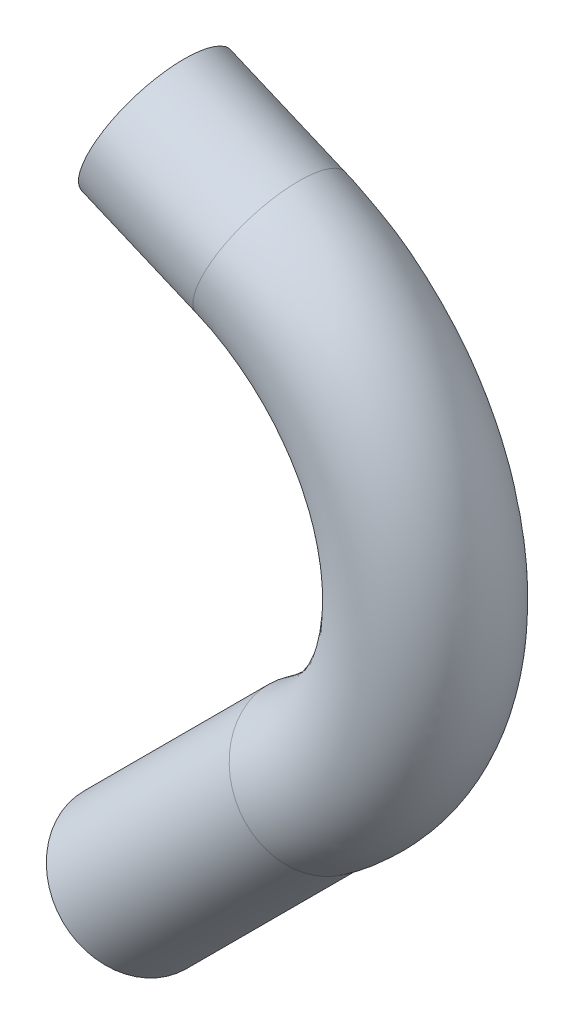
ISO-10303-21;
HEADER;
FILE_DESCRIPTION(('STEP AP214'),'2;1');
FILE_NAME('part.step','',(''),(''),'','','');
FILE_SCHEMA(('AUTOMOTIVE_DESIGN { 1 0 10303 214 1 1 1 1 }'));
ENDSEC;
DATA;
#1=APPLICATION_CONTEXT('core data for automotive mechanical design processes');
#2=APPLICATION_PROTOCOL_DEFINITION('international standard','automotive_design',2000,#1);
#3=PRODUCT_CONTEXT('',#1,'mechanical');
#4=PRODUCT('Part','Part','',(#3));
#5=PRODUCT_RELATED_PRODUCT_CATEGORY('part','',(#4));
#6=PRODUCT_DEFINITION_FORMATION('','',#4);
#7=PRODUCT_DEFINITION_CONTEXT('part definition',#1,'design');
#8=PRODUCT_DEFINITION('design','',#6,#7);
#9=PRODUCT_DEFINITION_SHAPE('','',#8);
#10=(LENGTH_UNIT() NAMED_UNIT(*) SI_UNIT(.MILLI.,.METRE.));
#11=(NAMED_UNIT(*) PLANE_ANGLE_UNIT() SI_UNIT($,.RADIAN.));
#12=(NAMED_UNIT(*) SI_UNIT($,.STERADIAN.) SOLID_ANGLE_UNIT());
#13=UNCERTAINTY_MEASURE_WITH_UNIT(LENGTH_MEASURE(1.E-05),#10,'distance_accuracy_value','');
#14=(GEOMETRIC_REPRESENTATION_CONTEXT(3) GLOBAL_UNCERTAINTY_ASSIGNED_CONTEXT((#13)) GLOBAL_UNIT_ASSIGNED_CONTEXT((#10,
#11,#12)) REPRESENTATION_CONTEXT('',''));
#15=CARTESIAN_POINT('',(0.,0.,0.));
#16=DIRECTION('',(0.,0.,1.));
#17=DIRECTION('',(1.,0.,0.));
#18=AXIS2_PLACEMENT_3D('',#15,#16,#17);
#19=CARTESIAN_POINT('',(26.7616358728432,90.3607575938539,0.));
#20=DIRECTION('',(0.92279595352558,-0.385289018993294,0.));
#21=DIRECTION('',(0.385289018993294,0.92279595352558,0.));
#22=AXIS2_PLACEMENT_3D('',#19,#20,#21);
#23=CIRCLE('',#22,9.52499999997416);
#24=DIRECTION('',(-0.920504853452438,0.390731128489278,0.));
#25=VECTOR('',#24,1.);
#26=SURFACE_OF_LINEAR_EXTRUSION('',#23,#25);
#27=CARTESIAN_POINT('',(30.4315137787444,99.1503890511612,0.));
#28=VERTEX_POINT('',#27);
#29=EDGE_CURVE('E44',#28,#28,#23,.T.);
#30=ORIENTED_EDGE('',*,*,#29,.F.);
#31=EDGE_LOOP('',(#30));
#32=FACE_BOUND('',#31,.T.);
#33=CARTESIAN_POINT('',(11.7332700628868,96.739920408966,0.));
#34=DIRECTION('',(0.92279595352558,-0.385289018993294,0.));
#35=DIRECTION('',(0.385289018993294,0.92279595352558,0.));
#36=AXIS2_PLACEMENT_3D('',#33,#34,#35);
#37=CIRCLE('',#36,9.52499999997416);
#38=CARTESIAN_POINT('',(15.4031479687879,105.529551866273,0.));
#39=VERTEX_POINT('',#38);
#40=EDGE_CURVE('E10',#39,#39,#37,.T.);
#41=ORIENTED_EDGE('',*,*,#40,.T.);
#42=EDGE_LOOP('',(#41));
#43=FACE_BOUND('',#42,.T.);
#44=ADVANCED_FACE('F29',(#32,#43),#26,.F.);
#45=CARTESIAN_POINT('',(51.6827488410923,51.6827488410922,0.));
#46=DIRECTION('',(-0.707106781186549,-0.707106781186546,0.));
#47=DIRECTION('',(0.707106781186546,-0.707106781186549,0.));
#48=AXIS2_PLACEMENT_3D('',#45,#46,#47);
#49=CYLINDRICAL_SURFACE('',#48,9.525);
#50=CARTESIAN_POINT('',(8.98025612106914,8.98025612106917,0.));
#51=DIRECTION('',(0.707106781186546,0.707106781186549,0.));
#52=DIRECTION('',(-0.707106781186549,0.707106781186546,0.));
#53=AXIS2_PLACEMENT_3D('',#50,#51,#52);
#54=CIRCLE('',#53,9.525);
#55=CARTESIAN_POINT('',(2.24506403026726,15.715448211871,0.));
#56=VERTEX_POINT('',#55);
#57=EDGE_CURVE('E40',#56,#56,#54,.T.);
#58=ORIENTED_EDGE('',*,*,#57,.T.);
#59=EDGE_LOOP('',(#58));
#60=FACE_BOUND('',#59,.T.);
#61=CARTESIAN_POINT('',(32.6327488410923,32.6327488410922,0.));
#62=DIRECTION('',(0.770089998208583,0.63793525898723,0.));
#63=DIRECTION('',(0.63793525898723,-0.770089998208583,0.));
#64=AXIS2_PLACEMENT_3D('',#61,#62,#63);
#65=ELLIPSE('',#64,9.56686260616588,9.525);
#66=CARTESIAN_POINT('',(38.735787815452,25.2654036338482,0.));
#67=VERTEX_POINT('',#66);
#68=EDGE_CURVE('E36',#67,#67,#65,.T.);
#69=ORIENTED_EDGE('',*,*,#68,.F.);
#70=EDGE_LOOP('',(#69));
#71=FACE_BOUND('',#70,.T.);
#72=ADVANCED_FACE('F53',(#60,#71),#49,.T.);
#73=CARTESIAN_POINT('',(8.98025612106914,8.98025612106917,0.));
#74=DIRECTION('',(0.707106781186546,0.707106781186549,0.));
#75=DIRECTION('',(-0.707106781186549,0.707106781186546,0.));
#76=AXIS2_PLACEMENT_3D('',#73,#74,#75);
#77=PLANE('',#76);
#78=ORIENTED_EDGE('',*,*,#57,.F.);
#79=EDGE_LOOP('',(#78));
#80=FACE_BOUND('',#79,.T.);
#81=ADVANCED_FACE('F57',(#80),#77,.F.);
#82=CARTESIAN_POINT('',(8.0633921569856,87.9502889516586,0.));
#83=DIRECTION('',(0.92279595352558,-0.385289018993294,0.));
#84=DIRECTION('',(0.385289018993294,0.92279595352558,0.));
#85=AXIS2_PLACEMENT_3D('',#82,#83,#84);
#86=PLANE('',#85);
#87=ORIENTED_EDGE('',*,*,#40,.F.);
#88=EDGE_LOOP('',(#87));
#89=FACE_BOUND('',#88,.T.);
#90=ADVANCED_FACE('F62',(#89),#86,.F.);
#91=CARTESIAN_POINT('',(38.7357878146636,25.2654036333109,0.));
#92=CARTESIAN_POINT('',(40.4488680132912,26.4329390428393,0.));
#93=CARTESIAN_POINT('',(44.0726059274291,29.5025986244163,0.));
#94=CARTESIAN_POINT('',(48.7274289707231,34.9774232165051,0.));
#95=CARTESIAN_POINT('',(51.9620229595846,40.3505769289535,0.));
#96=CARTESIAN_POINT('',(54.3378517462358,45.8742176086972,0.));
#97=CARTESIAN_POINT('',(55.843107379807,51.3687390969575,0.));
#98=CARTESIAN_POINT('',(56.5506060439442,56.7140541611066,0.));
#99=CARTESIAN_POINT('',(56.6279222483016,61.6941887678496,0.));
#100=CARTESIAN_POINT('',(56.119491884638,66.8824403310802,0.));
#101=CARTESIAN_POINT('',(54.7527762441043,72.7891471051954,0.));
#102=CARTESIAN_POINT('',(52.5114647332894,78.3806879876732,0.));
#103=CARTESIAN_POINT('',(49.599075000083,83.43075683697,0.));
#104=CARTESIAN_POINT('',(46.3303228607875,87.7950264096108,0.));
#105=CARTESIAN_POINT('',(42.0254011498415,92.1191645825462,0.));
#106=CARTESIAN_POINT('',(36.974330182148,95.9926511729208,0.));
#107=CARTESIAN_POINT('',(32.1540782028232,98.4311778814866,0.));
#108=CARTESIAN_POINT('',(30.4315137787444,99.1503890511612,0.));
#109=CARTESIAN_POINT('',(38.7357878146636,25.2654036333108,-19.05));
#110=CARTESIAN_POINT('',(39.7013343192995,25.923463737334,-19.05));
#111=CARTESIAN_POINT('',(44.3861824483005,29.7163140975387,-19.05));
#112=CARTESIAN_POINT('',(48.6574996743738,34.9297633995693,-19.05));
#113=CARTESIAN_POINT('',(51.9772563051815,40.3609593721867,-19.05));
#114=CARTESIAN_POINT('',(54.3333431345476,45.871143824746,-19.05));
#115=CARTESIAN_POINT('',(55.8441665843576,51.3694649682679,-19.05));
#116=CARTESIAN_POINT('',(56.5503927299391,56.7138972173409,-19.05));
#117=CARTESIAN_POINT('',(56.627949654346,61.6942459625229,-19.05));
#118=CARTESIAN_POINT('',(56.1196290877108,66.8823600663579,-19.05));
#119=CARTESIAN_POINT('',(54.7520162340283,72.7894724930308,-19.05));
#120=CARTESIAN_POINT('',(52.514453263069,78.3794386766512,-19.05));
#121=CARTESIAN_POINT('',(49.5913950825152,83.4339637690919,-19.05));
#122=CARTESIAN_POINT('',(46.3643684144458,87.7808114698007,-19.05));
#123=CARTESIAN_POINT('',(41.8776428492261,92.1808571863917,-19.05));
#124=CARTESIAN_POINT('',(37.6089607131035,95.7276779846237,-19.05));
#125=CARTESIAN_POINT('',(30.6626678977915,99.0538767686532,-19.05));
#126=CARTESIAN_POINT('',(30.4315137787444,99.1503890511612,-19.05));
#127=CARTESIAN_POINT('',(26.5297098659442,40.0000940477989,-19.05));
#128=CARTESIAN_POINT('',(27.4952563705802,40.6581541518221,-19.05));
#129=CARTESIAN_POINT('',(31.0952376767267,43.442894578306,-19.05));
#130=CARTESIAN_POINT('',(33.0869552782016,46.0713989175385,-19.05));
#131=CARTESIAN_POINT('',(35.0010409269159,49.125237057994,-19.05));
#132=CARTESIAN_POINT('',(36.2829031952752,52.1543841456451,-19.05));
#133=CARTESIAN_POINT('',(37.1223048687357,55.1934630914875,-19.05));
#134=CARTESIAN_POINT('',(37.5109601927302,58.1431198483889,-19.05));
#135=CARTESIAN_POINT('',(37.5540535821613,60.8927998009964,-19.05));
#136=CARTESIAN_POINT('',(37.2733326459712,63.7569467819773,-19.05));
#137=CARTESIAN_POINT('',(36.5184075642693,67.018070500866,-19.05));
#138=CARTESIAN_POINT('',(35.2828497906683,70.1042193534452,-19.05));
#139=CARTESIAN_POINT('',(33.6698631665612,72.894356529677,-19.05));
#140=CARTESIAN_POINT('',(31.8854253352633,75.2953244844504,-19.05));
#141=CARTESIAN_POINT('',(29.4210662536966,77.7191824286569,-19.05));
#142=CARTESIAN_POINT('',(27.0101428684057,79.6999500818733,-19.05));
#143=CARTESIAN_POINT('',(23.3229120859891,81.4746138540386,-19.05));
#144=CARTESIAN_POINT('',(23.091757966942,81.5711261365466,-19.05));
#145=CARTESIAN_POINT('',(26.5297098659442,40.0000940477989,0.));
#146=CARTESIAN_POINT('',(27.869023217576,40.9128918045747,0.));
#147=CARTESIAN_POINT('',(30.938449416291,43.3360368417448,0.));
#148=CARTESIAN_POINT('',(33.1219199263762,46.0952288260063,0.));
#149=CARTESIAN_POINT('',(34.9934242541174,49.1200458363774,0.));
#150=CARTESIAN_POINT('',(36.2851575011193,52.1559210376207,0.));
#151=CARTESIAN_POINT('',(37.1217752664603,55.1931001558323,0.));
#152=CARTESIAN_POINT('',(37.5110668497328,58.1431983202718,0.));
#153=CARTESIAN_POINT('',(37.5540398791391,60.8927712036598,0.));
#154=CARTESIAN_POINT('',(37.2732640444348,63.7569869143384,0.));
#155=CARTESIAN_POINT('',(36.5187875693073,67.0179078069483,0.));
#156=CARTESIAN_POINT('',(35.2813555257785,70.1048440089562,0.));
#157=CARTESIAN_POINT('',(33.6737031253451,72.892753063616,0.));
#158=CARTESIAN_POINT('',(31.8684025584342,75.3024319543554,0.));
#159=CARTESIAN_POINT('',(29.4949454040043,77.6883361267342,0.));
#160=CARTESIAN_POINT('',(26.692827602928,79.8324366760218,0.));
#161=CARTESIAN_POINT('',(24.068617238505,81.1632644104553,0.));
#162=CARTESIAN_POINT('',(23.091757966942,81.5711261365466,0.));
#163=CARTESIAN_POINT('',(26.5297098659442,40.0000940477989,19.05));
#164=CARTESIAN_POINT('',(28.2427900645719,41.1676294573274,19.05));
#165=CARTESIAN_POINT('',(30.7816611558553,43.2291791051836,19.05));
#166=CARTESIAN_POINT('',(33.1568845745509,46.1190587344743,19.05));
#167=CARTESIAN_POINT('',(34.985807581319,49.1148546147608,19.05));
#168=CARTESIAN_POINT('',(36.2874118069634,52.1574579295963,19.05));
#169=CARTESIAN_POINT('',(37.121245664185,55.192737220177,19.05));
#170=CARTESIAN_POINT('',(37.5111735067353,58.1432767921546,19.05));
#171=CARTESIAN_POINT('',(37.5540261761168,60.8927426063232,19.05));
#172=CARTESIAN_POINT('',(37.2731954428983,63.7570270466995,19.05));
#173=CARTESIAN_POINT('',(36.5191675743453,67.0177451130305,19.05));
#174=CARTESIAN_POINT('',(35.2798612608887,70.1054686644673,19.05));
#175=CARTESIAN_POINT('',(33.677543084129,72.891149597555,19.05));
#176=CARTESIAN_POINT('',(31.851379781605,75.3095394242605,19.05));
#177=CARTESIAN_POINT('',(29.568824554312,77.6574898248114,19.05));
#178=CARTESIAN_POINT('',(26.3755123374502,79.9649232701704,19.05));
#179=CARTESIAN_POINT('',(24.8143223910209,80.851914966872,19.05));
#180=CARTESIAN_POINT('',(23.091757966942,81.5711261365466,19.05));
#181=CARTESIAN_POINT('',(38.7357878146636,25.2654036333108,19.05));
#182=CARTESIAN_POINT('',(41.1964017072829,26.9424143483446,19.05));
#183=CARTESIAN_POINT('',(43.7590294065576,29.288883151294,19.05));
#184=CARTESIAN_POINT('',(48.7973582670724,35.0250830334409,19.05));
#185=CARTESIAN_POINT('',(51.9467896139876,40.3401944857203,19.05));
#186=CARTESIAN_POINT('',(54.342360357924,45.8772913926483,19.05));
#187=CARTESIAN_POINT('',(55.8420481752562,51.3680132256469,19.05));
#188=CARTESIAN_POINT('',(56.5508193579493,56.7142111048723,19.05));
#189=CARTESIAN_POINT('',(56.6278948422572,61.6941315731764,19.05));
#190=CARTESIAN_POINT('',(56.1193546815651,66.8825205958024,19.05));
#191=CARTESIAN_POINT('',(54.7535362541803,72.7888217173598,19.05));
#192=CARTESIAN_POINT('',(52.5084762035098,78.3819372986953,19.05));
#193=CARTESIAN_POINT('',(49.6067549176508,83.427549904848,19.05));
#194=CARTESIAN_POINT('',(46.2962773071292,87.8092413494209,19.05));
#195=CARTESIAN_POINT('',(42.1731594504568,92.0574719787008,19.05));
#196=CARTESIAN_POINT('',(36.3396996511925,96.2576243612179,19.05));
#197=CARTESIAN_POINT('',(33.645488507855,97.8084789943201,19.05));
#198=CARTESIAN_POINT('',(30.4315137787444,99.1503890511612,19.05));
#199=CARTESIAN_POINT('',(38.7357878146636,25.2654036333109,0.));
#200=CARTESIAN_POINT('',(40.4488680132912,26.4329390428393,0.));
#201=CARTESIAN_POINT('',(44.0726059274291,29.5025986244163,0.));
#202=CARTESIAN_POINT('',(48.7274289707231,34.9774232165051,0.));
#203=CARTESIAN_POINT('',(51.9620229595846,40.3505769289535,0.));
#204=CARTESIAN_POINT('',(54.3378517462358,45.8742176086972,0.));
#205=CARTESIAN_POINT('',(55.843107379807,51.3687390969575,0.));
#206=CARTESIAN_POINT('',(56.5506060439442,56.7140541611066,0.));
#207=CARTESIAN_POINT('',(56.6279222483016,61.6941887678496,0.));
#208=CARTESIAN_POINT('',(56.119491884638,66.8824403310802,0.));
#209=CARTESIAN_POINT('',(54.7527762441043,72.7891471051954,0.));
#210=CARTESIAN_POINT('',(52.5114647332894,78.3806879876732,0.));
#211=CARTESIAN_POINT('',(49.599075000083,83.43075683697,0.));
#212=CARTESIAN_POINT('',(46.3303228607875,87.7950264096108,0.));
#213=CARTESIAN_POINT('',(42.0254011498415,92.1191645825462,0.));
#214=CARTESIAN_POINT('',(36.974330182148,95.9926511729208,0.));
#215=CARTESIAN_POINT('',(32.1540782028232,98.4311778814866,0.));
#216=CARTESIAN_POINT('',(30.4315137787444,99.1503890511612,0.));
#217=(BOUNDED_SURFACE() B_SPLINE_SURFACE(3,3,((#91,#92,#93,#94,#95,#96,#97,#98,#99,#100,#101,
#102,#103,#104,#105,#106,#107,#108),(#109,#110,#111,#112,#113,#114,#115,#116,#117,#118,#119,
#120,#121,#122,#123,#124,#125,#126),(#127,#128,#129,#130,#131,#132,#133,#134,#135,#136,#137,
#138,#139,#140,#141,#142,#143,#144),(#145,#146,#147,#148,#149,#150,#151,#152,#153,#154,#155,
#156,#157,#158,#159,#160,#161,#162),(#163,#164,#165,#166,#167,#168,#169,#170,#171,#172,#173,
#174,#175,#176,#177,#178,#179,#180),(#181,#182,#183,#184,#185,#186,#187,#188,#189,#190,#191,
#192,#193,#194,#195,#196,#197,#198),(#199,#200,#201,#202,#203,#204,#205,#206,#207,#208,#209,
#210,#211,#212,#213,#214,#215,#216)),.UNSPECIFIED.,.T.,.F.,.F.) B_SPLINE_SURFACE_WITH_KNOTS((4,
3,4),(4,1,1,1,1,1,1,1,1,1,1,1,1,1,1,4),(0.,0.5,1.),(0.,0.08623970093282,0.164085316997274,
0.232555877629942,0.292631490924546,0.361434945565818,0.41947217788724,0.469726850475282,
0.525139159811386,0.590731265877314,0.668725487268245,0.722536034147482,0.7822159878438,
0.848206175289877,0.92079198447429,1.),
.UNSPECIFIED.) GEOMETRIC_REPRESENTATION_ITEM() RATIONAL_B_SPLINE_SURFACE(((1.,1.,1.,1.,1.,1.,1.,
1.,1.,1.,1.,1.,1.,1.,1.,1.,1.,1.),(0.333333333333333,0.333333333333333,0.333333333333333,
0.333333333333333,0.333333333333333,0.333333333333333,0.333333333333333,0.333333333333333,
0.333333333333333,0.333333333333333,0.333333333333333,0.333333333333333,0.333333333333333,
0.333333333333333,0.333333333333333,0.333333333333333,0.333333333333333,0.333333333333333),
(0.333333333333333,0.333333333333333,0.333333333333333,0.333333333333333,0.333333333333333,
0.333333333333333,0.333333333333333,0.333333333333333,0.333333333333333,0.333333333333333,
0.333333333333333,0.333333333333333,0.333333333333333,0.333333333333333,0.333333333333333,
0.333333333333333,0.333333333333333,0.333333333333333),(1.,1.,1.,1.,1.,1.,1.,1.,1.,1.,1.,1.,1.,
1.,1.,1.,1.,1.),(0.333333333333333,0.333333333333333,0.333333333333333,0.333333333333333,
0.333333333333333,0.333333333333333,0.333333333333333,0.333333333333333,0.333333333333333,
0.333333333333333,0.333333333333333,0.333333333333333,0.333333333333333,0.333333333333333,
0.333333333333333,0.333333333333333,0.333333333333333,0.333333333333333),(0.333333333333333,
0.333333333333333,0.333333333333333,0.333333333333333,0.333333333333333,0.333333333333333,
0.333333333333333,0.333333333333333,0.333333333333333,0.333333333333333,0.333333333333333,
0.333333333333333,0.333333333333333,0.333333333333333,0.333333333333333,0.333333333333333,
0.333333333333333,0.333333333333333),(1.,1.,1.,1.,1.,1.,1.,1.,1.,1.,1.,1.,1.,1.,1.,1.,1.,1.))) REPRESENTATION_ITEM('') SURFACE());
#218=ORIENTED_EDGE('',*,*,#68,.T.);
#219=EDGE_LOOP('',(#218));
#220=FACE_BOUND('',#219,.T.);
#221=ORIENTED_EDGE('',*,*,#29,.T.);
#222=EDGE_LOOP('',(#221));
#223=FACE_BOUND('',#222,.T.);
#224=ADVANCED_FACE('F50',(#220,#223),#217,.T.);
#225=CLOSED_SHELL('',(#44,#72,#81,#90,#224));
#226=MANIFOLD_SOLID_BREP('B2',#225);
#227=ADVANCED_BREP_SHAPE_REPRESENTATION('',(#18,#226),#14);
#228=SHAPE_DEFINITION_REPRESENTATION(#9,#227);
ENDSEC;
END-ISO-10303-21;
